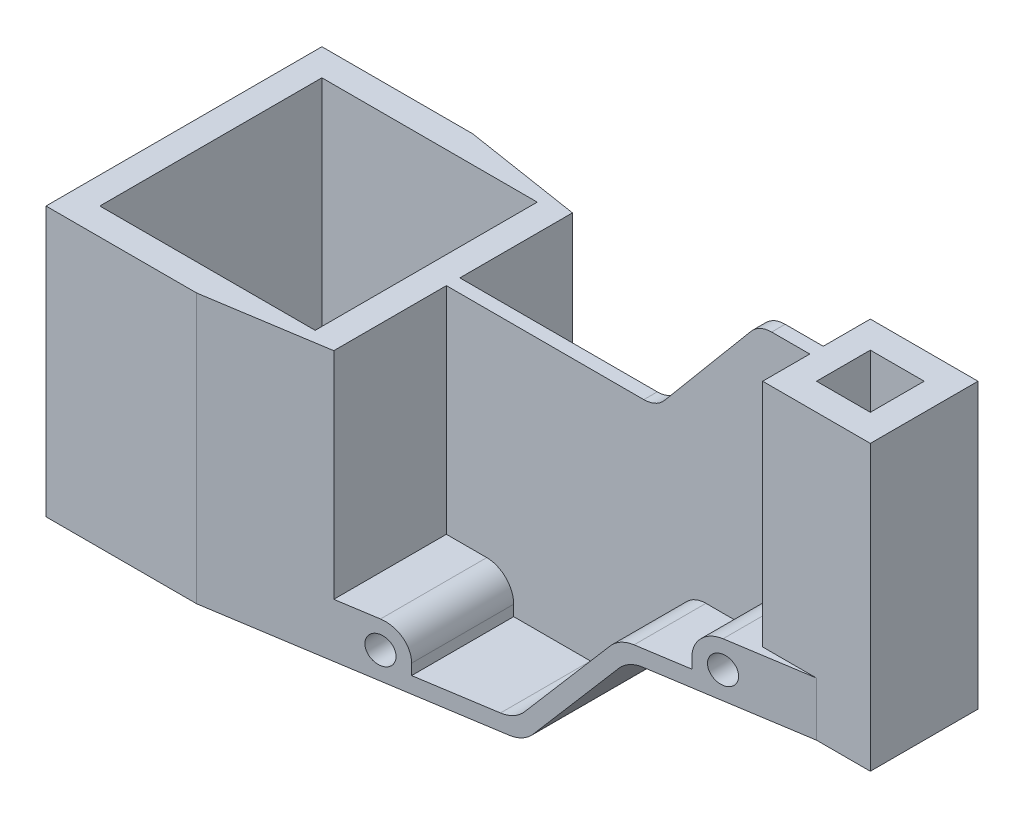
from build123d import *

# Parameters (mm, degrees)
ESQUISSE1_R                  = 5
BOSS_EXTRU_1_DEPTH           = 51.25
ENL_V_MAT_EXTRU_1_DEPTH      = 193.529273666
ESQUISSE8_W                  = 40
ESQUISSE8_H                  = 40
BOSS_EXTRU_2_DEPTH           = 85.5
ESQUISSE9_W                  = 20
ESQUISSE9_H                  = 40
BOSS_EXTRU_3_DEPTH           = 20
BOSS_EXTRU_4_DEPTH           = 2.5
ENL_V_MAT_EXTRU_2_DEPTH      = 193.529273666
ENL_V_MAT_EXTRU_2_DEPTH_BACK = 193.529273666
ESQUISSE12_W                 = 80
ESQUISSE12_H                 = 82.5
ESQUISSE12_W_2               = 20
ESQUISSE12_H_2               = 20


with BuildPart() as part:
    # Esquisse1 → Boss.-Extru.1 (new, symmetric)
    with BuildSketch(Plane.XY):
        with BuildLine():
            Line((98.663955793, 60), (68.663955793, 60))
            ThreePointArc((68.663955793, 60), (61.592887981, 57.071067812), (58.663955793, 50))
            Line((58.663955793, 50), (58.663955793, 46))
            Line((58.663955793, 46), (40.092292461, 46))
            ThreePointArc((40.092292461, 46), (35.866109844, 45.06307787), (32.43184803, 42.427876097))
            Line((32.43184803, 42.427876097), (4.862598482, 9.572123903))
            ThreePointArc((4.862598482, 9.572123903), (1.428336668, 6.93692213), (-2.797845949, 6))
            Line((-2.797845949, 6), (-31.336044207, 6))
            Line((-31.336044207, 6), (-31.336044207, 10))
            ThreePointArc((-31.336044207, 10), (-34.264976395, 17.071067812), (-41.336044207, 20))
            Line((-41.336044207, 20), (-56.336044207, 20))
            Line((-56.336044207, 20), (-56.336044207, 100))
            Line((-56.336044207, 100), (-156.336044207, 100))
            Line((-156.336044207, 100), (-156.336044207, 0))
            Line((-156.336044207, 0), (0, 0))
            ThreePointArc((0, 0), (4.226182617, 0.93692213), (7.660444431, 3.572123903))
            Line((7.660444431, 3.572123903), (35.229693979, 36.427876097))
            ThreePointArc((35.229693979, 36.427876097), (38.663955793, 39.06307787), (42.89013841, 40))
            Line((42.89013841, 40), (98.663955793, 40))
            Line((98.663955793, 40), (98.663955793, 60))
        make_face()
        with Locations(Location((68.663955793, 50, 0), (0, 0, 180))):
            Circle(ESQUISSE1_R, mode=Mode.SUBTRACT)
        with Locations(Location((-41.336044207, 10, 0), (0, 0, 180))):
            Circle(ESQUISSE1_R, mode=Mode.SUBTRACT)
    extrude(amount=BOSS_EXTRU_1_DEPTH, both=True)

    # Esquisse5 → Enl_v. mat.-Extru.1 (cut, through all)
    with BuildSketch(Plane(origin=(0, 0, 0), x_dir=(1, 0, 0), z_dir=(0, 1, 0))):
        Polygon((-100.336044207, -51.25), (98.663955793, -20), (98.663955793, -51.25), align=None)
        Polygon((98.663955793, 20), (98.663955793, 51.25), (-100.336044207, 51.25), align=None)
    extrude(amount=ENL_V_MAT_EXTRU_1_DEPTH, mode=Mode.SUBTRACT)

    # Esquisse8 → Boss.-Extru.2 (add)
    with BuildSketch(Plane(origin=(0, 60, 0), x_dir=(1, 0, 0), z_dir=(0, 1, 0))):
        with Locations((98.663955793, 0)):
            Rectangle(ESQUISSE8_W, ESQUISSE8_H)
    extrude(amount=BOSS_EXTRU_2_DEPTH)

    # Esquisse9 → Boss.-Extru.3 (add)
    with BuildSketch(Plane.XZ.offset(-40)):
        with Locations((108.663955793, 0)):
            Rectangle(ESQUISSE9_W, ESQUISSE9_H)
    extrude(amount=-BOSS_EXTRU_3_DEPTH)

    # Esquisse11 → Boss.-Extru.4 (add, symmetric)
    with BuildSketch(Plane.XY):
        with BuildLine():
            Line((24.668283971, 103.572123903), (56.85258149, 141.927876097))
            ThreePointArc((56.85258149, 141.927876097), (60.286843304, 144.56307787), (64.513025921, 145.5))
            Line((64.513025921, 145.5), (78.663955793, 145.5))
            Line((78.663955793, 145.5), (78.663955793, 60))
            Line((78.663955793, 60), (68.663955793, 60))
            ThreePointArc((68.663955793, 60), (61.592887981, 57.071067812), (58.663955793, 50))
            Line((58.663955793, 50), (58.663955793, 46))
            Line((58.663955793, 46), (40.092292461, 46))
            ThreePointArc((40.092292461, 46), (35.866109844, 45.06307787), (32.43184803, 42.427876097))
            Line((32.43184803, 42.427876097), (4.862598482, 9.572123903))
            ThreePointArc((4.862598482, 9.572123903), (1.428336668, 6.93692213), (-2.797845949, 6))
            Line((-2.797845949, 6), (-31.336044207, 6))
            Line((-31.336044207, 6), (-31.336044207, 10))
            ThreePointArc((-31.336044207, 10), (-34.264976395, 17.071067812), (-41.336044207, 20))
            Line((-41.336044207, 20), (-56.336044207, 20))
            Line((-56.336044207, 20), (-56.336044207, 100))
            Line((-56.336044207, 100), (17.007839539, 100))
            ThreePointArc((17.007839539, 100), (21.234022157, 100.93692213), (24.668283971, 103.572123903))
        make_face()
    extrude(amount=BOSS_EXTRU_4_DEPTH, both=True)

    # Esquisse12 → Enl_v. mat.-Extru.2 (cut, two sides: drawn at the far end of the back side and taken through both)
    with BuildSketch(Plane(origin=(0, 100, 0), x_dir=(1, 0, 0), z_dir=(0, 1, 0)).offset(-ENL_V_MAT_EXTRU_2_DEPTH_BACK)):
        with Locations((-106.336044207, 0)):
            Rectangle(ESQUISSE12_W, ESQUISSE12_H)
        with Locations((98.663955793, 0)):
            Rectangle(ESQUISSE12_W_2, ESQUISSE12_H_2)
    extrude(amount=ENL_V_MAT_EXTRU_2_DEPTH + ENL_V_MAT_EXTRU_2_DEPTH_BACK, mode=Mode.SUBTRACT)


solid = part.part
